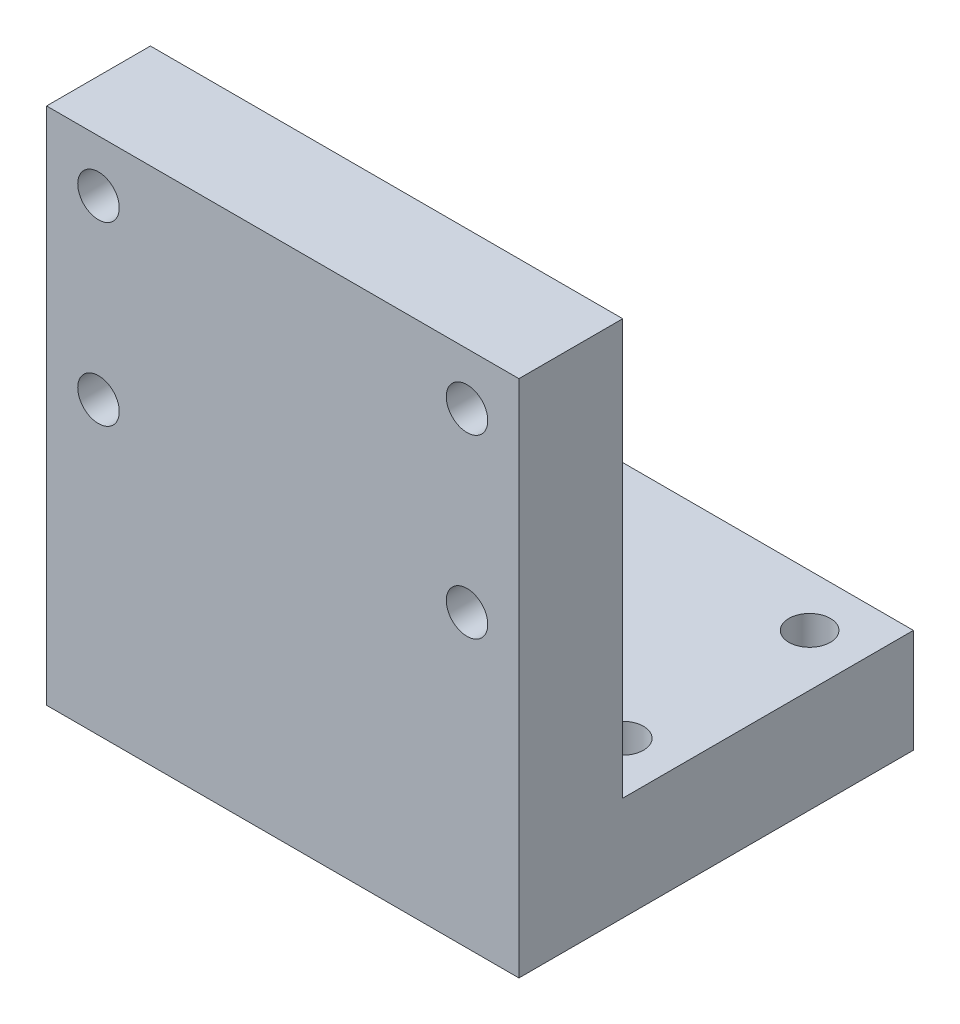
from build123d import *

# Parameters (mm, degrees)
SKETCH1_R              = 2
BASE_EXTRUSION_DEPTH   = 10
SKETCH2_R              = 3
FIRST_BASE_HOLES_DEPTH = 6
SKETCH5_W              = 45.5
SKETCH5_H              = 10
BOSS_EXTRUDE3_DEPTH    = 50
CUT_EXTRUDE2_REACH     = 63.657
SKETCH6_R              = 2
SKETCH7_R              = 3
CUT_EXTRUDE3_DEPTH     = 6


with BuildPart() as part:
    # Sketch1 → Base Extrusion (new body)
    with BuildSketch(Plane(origin=(0, 0, 0), x_dir=(1, 0, 0), z_dir=(0, 1, 0))):
        Polygon((-22.75, 14), (0, 14), (22.75, 14), (22.75, -14), (-22.75, -14), align=None)
        with Locations(Location((-17.75, 9, 0), (0, 0, 270))):
            Circle(SKETCH1_R, mode=Mode.SUBTRACT)
        with Locations(Location((-17.75, -9, 0), (0, 0, 270))):
            Circle(SKETCH1_R, mode=Mode.SUBTRACT)
        with Locations(Location((17.75, 9, 0), (0, 0, 270))):
            Circle(SKETCH1_R, mode=Mode.SUBTRACT)
        with Locations(Location((17.75, -9, 0), (0, 0, 270))):
            Circle(SKETCH1_R, mode=Mode.SUBTRACT)
    extrude(amount=BASE_EXTRUSION_DEPTH)

    # Sketch2 → First Base Holes (cut)
    with BuildSketch(Plane.XZ):
        with Locations(Location((-17.75, 9, 0), (0, 0, 270))):
            Circle(SKETCH2_R)
        with Locations(Location((-17.75, -9, 0), (0, 0, 270))):
            Circle(SKETCH2_R)
        with Locations(Location((17.75, -9, 0), (0, 0, 90))):
            Circle(SKETCH2_R)
        with Locations(Location((17.75, 9, 0), (0, 0, 90))):
            Circle(SKETCH2_R)
    extrude(amount=-FIRST_BASE_HOLES_DEPTH, mode=Mode.SUBTRACT)

    # Sketch5 → Boss-Extrude3 (add)
    with BuildSketch(Plane(origin=(0, 0, 0), x_dir=(1, 0, 0), z_dir=(0, 1, 0))):
        with Locations((0, -19)):
            Rectangle(SKETCH5_W, SKETCH5_H)
    extrude(amount=BOSS_EXTRUDE3_DEPTH)

    # Sketch6 → Cut-Extrude2 (cut, up to next)
    with BuildSketch(Plane(origin=(0, 0, 14), x_dir=(-1, 0, 0), z_dir=(0, 0, -1)), mode=Mode.PRIVATE) as cut_extrude2_sk1:
        with Locations((-17.75, 45)):
            Circle(SKETCH6_R)
    cut_extrude2_tool1 = extrude(cut_extrude2_sk1.sketch, amount=-CUT_EXTRUDE2_REACH, mode=Mode.PRIVATE) & part.part
    # Sketch6 → Cut-Extrude2 (cut, up to next)
    with BuildSketch(Plane(origin=(0, 0, 14), x_dir=(-1, 0, 0), z_dir=(0, 0, -1)), mode=Mode.PRIVATE) as cut_extrude2_sk2:
        with Locations((-17.75, 28)):
            Circle(SKETCH6_R)
    cut_extrude2_tool2 = extrude(cut_extrude2_sk2.sketch, amount=-CUT_EXTRUDE2_REACH, mode=Mode.PRIVATE) & part.part
    # Sketch6 → Cut-Extrude2 (cut, up to next)
    with BuildSketch(Plane(origin=(0, 0, 14), x_dir=(-1, 0, 0), z_dir=(0, 0, -1)), mode=Mode.PRIVATE) as cut_extrude2_sk3:
        with Locations((17.75, 45)):
            Circle(SKETCH6_R)
    cut_extrude2_tool3 = extrude(cut_extrude2_sk3.sketch, amount=-CUT_EXTRUDE2_REACH, mode=Mode.PRIVATE) & part.part
    # Sketch6 → Cut-Extrude2 (cut, up to next)
    with BuildSketch(Plane(origin=(0, 0, 14), x_dir=(-1, 0, 0), z_dir=(0, 0, -1)), mode=Mode.PRIVATE) as cut_extrude2_sk4:
        with Locations((17.75, 28)):
            Circle(SKETCH6_R)
    cut_extrude2_tool4 = extrude(cut_extrude2_sk4.sketch, amount=-CUT_EXTRUDE2_REACH, mode=Mode.PRIVATE) & part.part
    add(cut_extrude2_tool1.solids().sort_by_distance((17.75, 45, 14))[0], mode=Mode.SUBTRACT)
    add(cut_extrude2_tool2.solids().sort_by_distance((17.75, 28, 14))[0], mode=Mode.SUBTRACT)
    add(cut_extrude2_tool3.solids().sort_by_distance((-17.75, 45, 14))[0], mode=Mode.SUBTRACT)
    add(cut_extrude2_tool4.solids().sort_by_distance((-17.75, 28, 14))[0], mode=Mode.SUBTRACT)

    # Sketch7 → Cut-Extrude3 (cut)
    with BuildSketch(Plane(origin=(0, 0, 14), x_dir=(-1, 0, 0), z_dir=(0, 0, -1))):
        with Locations((-17.75, 45)):
            Circle(SKETCH7_R)
        with Locations((-17.75, 28)):
            Circle(SKETCH7_R)
        with Locations(Location((17.75, 28, 0), (0, 0, 180))):
            Circle(SKETCH7_R)
        with Locations(Location((17.75, 45, 0), (0, 0, 180))):
            Circle(SKETCH7_R)
    extrude(amount=-CUT_EXTRUDE3_DEPTH, mode=Mode.SUBTRACT)


solid = part.part
